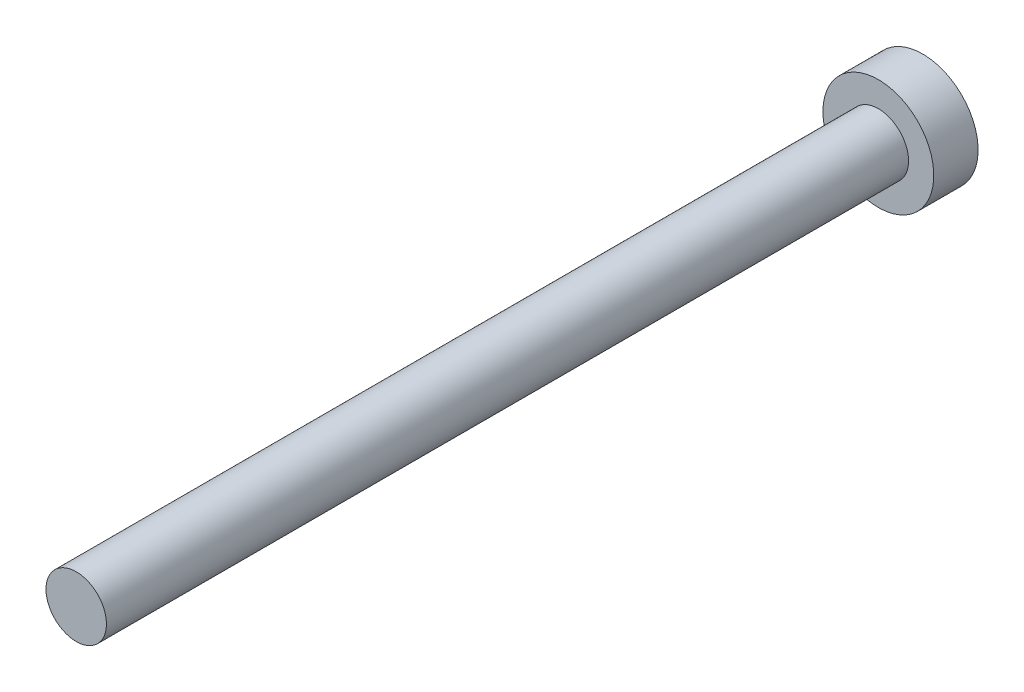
ISO-10303-21;
HEADER;
FILE_DESCRIPTION(('STEP AP214'),'2;1');
FILE_NAME('part.step','',(''),(''),'','','');
FILE_SCHEMA(('AUTOMOTIVE_DESIGN { 1 0 10303 214 1 1 1 1 }'));
ENDSEC;
DATA;
#1=APPLICATION_CONTEXT('core data for automotive mechanical design processes');
#2=APPLICATION_PROTOCOL_DEFINITION('international standard','automotive_design',2000,#1);
#3=PRODUCT_CONTEXT('',#1,'mechanical');
#4=PRODUCT('Part','Part','',(#3));
#5=PRODUCT_RELATED_PRODUCT_CATEGORY('part','',(#4));
#6=PRODUCT_DEFINITION_FORMATION('','',#4);
#7=PRODUCT_DEFINITION_CONTEXT('part definition',#1,'design');
#8=PRODUCT_DEFINITION('design','',#6,#7);
#9=PRODUCT_DEFINITION_SHAPE('','',#8);
#10=(LENGTH_UNIT() NAMED_UNIT(*) SI_UNIT(.MILLI.,.METRE.));
#11=(NAMED_UNIT(*) PLANE_ANGLE_UNIT() SI_UNIT($,.RADIAN.));
#12=(NAMED_UNIT(*) SI_UNIT($,.STERADIAN.) SOLID_ANGLE_UNIT());
#13=UNCERTAINTY_MEASURE_WITH_UNIT(LENGTH_MEASURE(1.E-05),#10,'distance_accuracy_value','');
#14=(GEOMETRIC_REPRESENTATION_CONTEXT(3) GLOBAL_UNCERTAINTY_ASSIGNED_CONTEXT((#13)) GLOBAL_UNIT_ASSIGNED_CONTEXT((#10,
#11,#12)) REPRESENTATION_CONTEXT('',''));
#15=CARTESIAN_POINT('',(0.,0.,0.));
#16=DIRECTION('',(0.,0.,1.));
#17=DIRECTION('',(1.,0.,0.));
#18=AXIS2_PLACEMENT_3D('',#15,#16,#17);
#19=CARTESIAN_POINT('',(0.,0.,63.));
#20=DIRECTION('',(0.,0.,-1.));
#21=DIRECTION('',(-1.,0.,0.));
#22=AXIS2_PLACEMENT_3D('',#19,#20,#21);
#23=CYLINDRICAL_SURFACE('',#22,2.25);
#24=CARTESIAN_POINT('',(0.,0.,63.));
#25=DIRECTION('',(0.,0.,1.));
#26=DIRECTION('',(1.,0.,0.));
#27=AXIS2_PLACEMENT_3D('',#24,#25,#26);
#28=CIRCLE('',#27,2.25);
#29=CARTESIAN_POINT('',(-2.25,0.,63.));
#30=VERTEX_POINT('',#29);
#31=EDGE_CURVE('E53',#30,#30,#28,.T.);
#32=CARTESIAN_POINT('',(0.,0.,3.3));
#33=DIRECTION('',(0.,0.,-1.));
#34=DIRECTION('',(-1.,0.,0.));
#35=AXIS2_PLACEMENT_3D('',#32,#33,#34);
#36=CIRCLE('',#35,2.25);
#37=CARTESIAN_POINT('',(-2.25,0.,3.3));
#38=VERTEX_POINT('',#37);
#39=EDGE_CURVE('E10',#38,#38,#36,.T.);
#40=CARTESIAN_POINT('',(-2.25,0.,63.));
#41=CARTESIAN_POINT('',(-2.25,0.,62.378125));
#42=CARTESIAN_POINT('',(-2.25,0.,61.75625));
#43=CARTESIAN_POINT('',(-2.25,0.,60.5125));
#44=CARTESIAN_POINT('',(-2.25,0.,59.890625));
#45=CARTESIAN_POINT('',(-2.25,0.,58.646875));
#46=CARTESIAN_POINT('',(-2.25,0.,58.025));
#47=CARTESIAN_POINT('',(-2.25,0.,56.78125));
#48=CARTESIAN_POINT('',(-2.25,0.,56.159375));
#49=CARTESIAN_POINT('',(-2.25,0.,54.915625));
#50=CARTESIAN_POINT('',(-2.25,0.,54.29375));
#51=CARTESIAN_POINT('',(-2.25,0.,53.05));
#52=CARTESIAN_POINT('',(-2.25,0.,52.428125));
#53=CARTESIAN_POINT('',(-2.25,0.,51.184375));
#54=CARTESIAN_POINT('',(-2.25,0.,50.5625));
#55=CARTESIAN_POINT('',(-2.25,0.,49.31875));
#56=CARTESIAN_POINT('',(-2.25,0.,48.696875));
#57=CARTESIAN_POINT('',(-2.25,0.,47.453125));
#58=CARTESIAN_POINT('',(-2.25,0.,46.83125));
#59=CARTESIAN_POINT('',(-2.25,0.,45.5875));
#60=CARTESIAN_POINT('',(-2.25,0.,44.965625));
#61=CARTESIAN_POINT('',(-2.25,0.,43.721875));
#62=CARTESIAN_POINT('',(-2.25,0.,43.1));
#63=CARTESIAN_POINT('',(-2.25,0.,41.85625));
#64=CARTESIAN_POINT('',(-2.25,0.,41.234375));
#65=CARTESIAN_POINT('',(-2.25,0.,39.990625));
#66=CARTESIAN_POINT('',(-2.25,0.,39.36875));
#67=CARTESIAN_POINT('',(-2.25,0.,38.125));
#68=CARTESIAN_POINT('',(-2.25,0.,37.503125));
#69=CARTESIAN_POINT('',(-2.25,0.,36.259375));
#70=CARTESIAN_POINT('',(-2.25,0.,35.6375));
#71=CARTESIAN_POINT('',(-2.25,0.,34.39375));
#72=CARTESIAN_POINT('',(-2.25,0.,33.771875));
#73=CARTESIAN_POINT('',(-2.25,0.,32.528125));
#74=CARTESIAN_POINT('',(-2.25,0.,31.90625));
#75=CARTESIAN_POINT('',(-2.25,0.,30.6625));
#76=CARTESIAN_POINT('',(-2.25,0.,30.040625));
#77=CARTESIAN_POINT('',(-2.25,0.,28.796875));
#78=CARTESIAN_POINT('',(-2.25,0.,28.175));
#79=CARTESIAN_POINT('',(-2.25,0.,26.93125));
#80=CARTESIAN_POINT('',(-2.25,0.,26.309375));
#81=CARTESIAN_POINT('',(-2.25,0.,25.065625));
#82=CARTESIAN_POINT('',(-2.25,0.,24.44375));
#83=CARTESIAN_POINT('',(-2.25,0.,23.2));
#84=CARTESIAN_POINT('',(-2.25,0.,22.578125));
#85=CARTESIAN_POINT('',(-2.25,0.,21.334375));
#86=CARTESIAN_POINT('',(-2.25,0.,20.7125));
#87=CARTESIAN_POINT('',(-2.25,0.,19.46875));
#88=CARTESIAN_POINT('',(-2.25,0.,18.846875));
#89=CARTESIAN_POINT('',(-2.25,0.,17.603125));
#90=CARTESIAN_POINT('',(-2.25,0.,16.98125));
#91=CARTESIAN_POINT('',(-2.25,0.,15.7375));
#92=CARTESIAN_POINT('',(-2.25,0.,15.115625));
#93=CARTESIAN_POINT('',(-2.25,0.,13.871875));
#94=CARTESIAN_POINT('',(-2.25,0.,13.25));
#95=CARTESIAN_POINT('',(-2.25,0.,12.00625));
#96=CARTESIAN_POINT('',(-2.25,0.,11.384375));
#97=CARTESIAN_POINT('',(-2.25,0.,10.140625));
#98=CARTESIAN_POINT('',(-2.25,0.,9.51875));
#99=CARTESIAN_POINT('',(-2.25,0.,8.275));
#100=CARTESIAN_POINT('',(-2.25,0.,7.653125));
#101=CARTESIAN_POINT('',(-2.25,0.,6.409375));
#102=CARTESIAN_POINT('',(-2.25,0.,5.7875));
#103=CARTESIAN_POINT('',(-2.25,0.,4.54375000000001));
#104=CARTESIAN_POINT('',(-2.25,0.,3.92187500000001));
#105=CARTESIAN_POINT('',(-2.25,0.,3.3));
#106=B_SPLINE_CURVE_WITH_KNOTS('',3,(#40,#41,#42,#43,#44,#45,#46,#47,#48,#49,#50,#51,#52,#53,
#54,#55,#56,#57,#58,#59,#60,#61,#62,#63,#64,#65,#66,#67,#68,#69,#70,#71,#72,#73,#74,#75,#76,#77,
#78,#79,#80,#81,#82,#83,#84,#85,#86,#87,#88,#89,#90,#91,#92,#93,#94,#95,#96,#97,#98,#99,#100,
#101,#102,#103,#104,#105),.UNSPECIFIED.,.F.,.F.,(4,2,2,2,2,2,2,2,2,2,2,2,2,2,2,2,2,2,2,2,2,2,2,
2,2,2,2,2,2,2,2,2,4),(0.,1.86562500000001,3.73125000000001,5.59687500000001,7.4625,
9.32812500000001,11.19375,13.059375,14.925,16.790625,18.65625,20.521875,22.3875,24.253125,
26.11875,27.984375,29.85,31.715625,33.58125,35.446875,37.3125,39.178125,41.04375,42.909375,
44.775,46.640625,48.50625,50.371875,52.2375,54.103125,55.96875,57.834375,59.7),.UNSPECIFIED.);
#107=EDGE_CURVE('BSEAM46',#30,#38,#106,.T.);
#108=ORIENTED_EDGE('',*,*,#31,.F.);
#109=ORIENTED_EDGE('',*,*,#39,.F.);
#110=ORIENTED_EDGE('',*,*,#107,.T.);
#111=ORIENTED_EDGE('',*,*,#107,.F.);
#112=EDGE_LOOP('',(#108,#110,#109,#111));
#113=FACE_BOUND('',#112,.T.);
#114=ADVANCED_FACE('F46',(#113),#23,.T.);
#115=CARTESIAN_POINT('',(0.,0.,63.));
#116=DIRECTION('',(0.,0.,1.));
#117=DIRECTION('',(1.,0.,0.));
#118=AXIS2_PLACEMENT_3D('',#115,#116,#117);
#119=PLANE('',#118);
#120=ORIENTED_EDGE('',*,*,#31,.T.);
#121=EDGE_LOOP('',(#120));
#122=FACE_BOUND('',#121,.T.);
#123=ADVANCED_FACE('F75',(#122),#119,.T.);
#124=CARTESIAN_POINT('',(0.,0.,3.3));
#125=DIRECTION('',(0.,0.,-1.));
#126=DIRECTION('',(-1.,0.,0.));
#127=AXIS2_PLACEMENT_3D('',#124,#125,#126);
#128=CYLINDRICAL_SURFACE('',#127,4.125);
#129=CARTESIAN_POINT('',(0.,0.,3.3));
#130=DIRECTION('',(0.,0.,-1.));
#131=DIRECTION('',(-1.,0.,0.));
#132=AXIS2_PLACEMENT_3D('',#129,#130,#131);
#133=CIRCLE('',#132,4.125);
#134=CARTESIAN_POINT('',(-4.125,0.,3.3));
#135=VERTEX_POINT('',#134);
#136=EDGE_CURVE('E58',#135,#135,#133,.T.);
#137=ORIENTED_EDGE('',*,*,#136,.T.);
#138=EDGE_LOOP('',(#137));
#139=FACE_BOUND('',#138,.T.);
#140=CARTESIAN_POINT('',(0.,0.,0.));
#141=DIRECTION('',(0.,0.,-1.));
#142=DIRECTION('',(-1.,0.,0.));
#143=AXIS2_PLACEMENT_3D('',#140,#141,#142);
#144=CIRCLE('',#143,4.125);
#145=CARTESIAN_POINT('',(-4.125,0.,0.));
#146=VERTEX_POINT('',#145);
#147=EDGE_CURVE('E63',#146,#146,#144,.T.);
#148=ORIENTED_EDGE('',*,*,#147,.F.);
#149=EDGE_LOOP('',(#148));
#150=FACE_BOUND('',#149,.T.);
#151=ADVANCED_FACE('F72',(#139,#150),#128,.T.);
#152=CARTESIAN_POINT('',(0.,0.,3.3));
#153=DIRECTION('',(0.,0.,-1.));
#154=DIRECTION('',(-1.,0.,0.));
#155=AXIS2_PLACEMENT_3D('',#152,#153,#154);
#156=PLANE('',#155);
#157=ORIENTED_EDGE('',*,*,#39,.T.);
#158=EDGE_LOOP('',(#157));
#159=FACE_BOUND('',#158,.T.);
#160=ORIENTED_EDGE('',*,*,#136,.F.);
#161=EDGE_LOOP('',(#160));
#162=FACE_BOUND('',#161,.T.);
#163=ADVANCED_FACE('F74',(#159,#162),#156,.F.);
#164=CARTESIAN_POINT('',(0.,0.,0.));
#165=DIRECTION('',(0.,0.,1.));
#166=DIRECTION('',(1.,0.,0.));
#167=AXIS2_PLACEMENT_3D('',#164,#165,#166);
#168=PLANE('',#167);
#169=ORIENTED_EDGE('',*,*,#147,.T.);
#170=EDGE_LOOP('',(#169));
#171=FACE_BOUND('',#170,.T.);
#172=ADVANCED_FACE('F70',(#171),#168,.F.);
#173=CLOSED_SHELL('',(#114,#123,#151,#163,#172));
#174=MANIFOLD_SOLID_BREP('B2',#173);
#175=ADVANCED_BREP_SHAPE_REPRESENTATION('',(#18,#174),#14);
#176=SHAPE_DEFINITION_REPRESENTATION(#9,#175);
ENDSEC;
END-ISO-10303-21;
